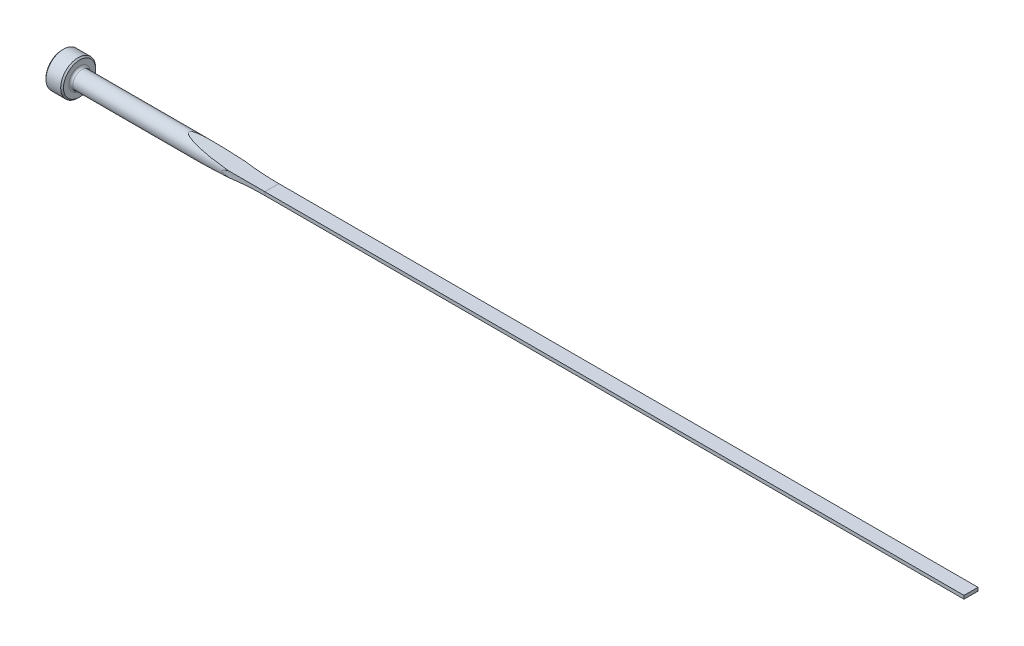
ISO-10303-21;
HEADER;
FILE_DESCRIPTION(('STEP AP214'),'2;1');
FILE_NAME('part.step','',(''),(''),'','','');
FILE_SCHEMA(('AUTOMOTIVE_DESIGN { 1 0 10303 214 1 1 1 1 }'));
ENDSEC;
DATA;
#1=APPLICATION_CONTEXT('core data for automotive mechanical design processes');
#2=APPLICATION_PROTOCOL_DEFINITION('international standard','automotive_design',2000,#1);
#3=PRODUCT_CONTEXT('',#1,'mechanical');
#4=PRODUCT('Part','Part','',(#3));
#5=PRODUCT_RELATED_PRODUCT_CATEGORY('part','',(#4));
#6=PRODUCT_DEFINITION_FORMATION('','',#4);
#7=PRODUCT_DEFINITION_CONTEXT('part definition',#1,'design');
#8=PRODUCT_DEFINITION('design','',#6,#7);
#9=PRODUCT_DEFINITION_SHAPE('','',#8);
#10=(LENGTH_UNIT() NAMED_UNIT(*) SI_UNIT(.MILLI.,.METRE.));
#11=(NAMED_UNIT(*) PLANE_ANGLE_UNIT() SI_UNIT($,.RADIAN.));
#12=(NAMED_UNIT(*) SI_UNIT($,.STERADIAN.) SOLID_ANGLE_UNIT());
#13=UNCERTAINTY_MEASURE_WITH_UNIT(LENGTH_MEASURE(1.E-05),#10,'distance_accuracy_value','');
#14=(GEOMETRIC_REPRESENTATION_CONTEXT(3) GLOBAL_UNCERTAINTY_ASSIGNED_CONTEXT((#13)) GLOBAL_UNIT_ASSIGNED_CONTEXT((#10,
#11,#12)) REPRESENTATION_CONTEXT('',''));
#15=CARTESIAN_POINT('',(0.,0.,0.));
#16=DIRECTION('',(0.,0.,1.));
#17=DIRECTION('',(1.,0.,0.));
#18=AXIS2_PLACEMENT_3D('',#15,#16,#17);
#19=CARTESIAN_POINT('',(0.,0.,0.));
#20=DIRECTION('',(-1.,0.,0.));
#21=DIRECTION('',(0.,0.,1.));
#22=AXIS2_PLACEMENT_3D('',#19,#20,#21);
#23=CYLINDRICAL_SURFACE('',#22,1.5875);
#24=CARTESIAN_POINT('',(3.556,0.,0.));
#25=DIRECTION('',(-1.,0.,0.));
#26=DIRECTION('',(0.,0.,1.));
#27=AXIS2_PLACEMENT_3D('',#24,#25,#26);
#28=CIRCLE('',#27,1.5875);
#29=CARTESIAN_POINT('',(3.556,0.,1.5875));
#30=VERTEX_POINT('',#29);
#31=EDGE_CURVE('E164',#30,#30,#28,.F.);
#32=ORIENTED_EDGE('',*,*,#31,.T.);
#33=EDGE_LOOP('',(#32));
#34=FACE_BOUND('',#33,.T.);
#35=CARTESIAN_POINT('',(38.1,0.952500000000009,1.26999999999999));
#36=CARTESIAN_POINT('',(37.8359370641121,0.952472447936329,1.26999969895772));
#37=CARTESIAN_POINT('',(37.5718719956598,0.950929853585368,1.27117652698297));
#38=CARTESIAN_POINT('',(37.0437498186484,0.944621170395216,1.27588282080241));
#39=CARTESIAN_POINT('',(36.7796927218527,0.939854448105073,1.27941274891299));
#40=CARTESIAN_POINT('',(36.2503777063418,0.926871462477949,1.28884723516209));
#41=CARTESIAN_POINT('',(35.9851204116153,0.918638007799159,1.29476362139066));
#42=CARTESIAN_POINT('',(35.4548543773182,0.898288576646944,1.30896501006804));
#43=CARTESIAN_POINT('',(35.1898456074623,0.88617315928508,1.31724967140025));
#44=CARTESIAN_POINT('',(34.6601718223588,0.857369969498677,1.33617874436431));
#45=CARTESIAN_POINT('',(34.3955067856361,0.840682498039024,1.34682300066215));
#46=CARTESIAN_POINT('',(33.8665932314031,0.801572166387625,1.37045957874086));
#47=CARTESIAN_POINT('',(33.6023449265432,0.779146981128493,1.38345285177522));
#48=CARTESIAN_POINT('',(33.0751041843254,0.726695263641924,1.41173301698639));
#49=CARTESIAN_POINT('',(32.8121104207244,0.696680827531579,1.42701624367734));
#50=CARTESIAN_POINT('',(32.419006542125,0.642939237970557,1.45160532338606));
#51=CARTESIAN_POINT('',(32.2882488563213,0.623580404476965,1.46007578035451));
#52=CARTESIAN_POINT('',(32.0274086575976,0.580985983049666,1.47754992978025));
#53=CARTESIAN_POINT('',(31.8973260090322,0.557751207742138,1.48655351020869));
#54=CARTESIAN_POINT('',(31.7029417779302,0.51869086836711,1.50043429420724));
#55=CARTESIAN_POINT('',(31.6382079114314,0.50495402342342,1.50512852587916));
#56=CARTESIAN_POINT('',(31.5091163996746,0.475697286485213,1.51463106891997));
#57=CARTESIAN_POINT('',(31.444758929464,0.460176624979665,1.51943942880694));
#58=CARTESIAN_POINT('',(31.3166394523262,0.426797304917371,1.52915077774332));
#59=CARTESIAN_POINT('',(31.2528776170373,0.408937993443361,1.53405379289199));
#60=CARTESIAN_POINT('',(31.1263676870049,0.369981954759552,1.54391773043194));
#61=CARTESIAN_POINT('',(31.0636187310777,0.348888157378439,1.54887859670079));
#62=CARTESIAN_POINT('',(30.9537745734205,0.306832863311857,1.55767690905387));
#63=CARTESIAN_POINT('',(30.9062912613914,0.286877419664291,1.5615197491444));
#64=CARTESIAN_POINT('',(30.8135147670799,0.242118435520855,1.56910131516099));
#65=CARTESIAN_POINT('',(30.7682167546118,0.217326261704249,1.57284026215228));
#66=CARTESIAN_POINT('',(30.7094526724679,0.176210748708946,1.5777311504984));
#67=CARTESIAN_POINT('',(30.6933005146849,0.163830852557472,1.57908035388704));
#68=CARTESIAN_POINT('',(30.6628115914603,0.137009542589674,1.58163476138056));
#69=CARTESIAN_POINT('',(30.6484664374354,0.12257837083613,1.58284062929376));
#70=CARTESIAN_POINT('',(30.6298776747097,0.0993254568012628,1.58440687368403));
#71=CARTESIAN_POINT('',(30.6243089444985,0.0915828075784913,1.58487670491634));
#72=CARTESIAN_POINT('',(30.6142247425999,0.0754170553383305,1.58572829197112));
#73=CARTESIAN_POINT('',(30.609709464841,0.0669938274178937,1.58611003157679));
#74=CARTESIAN_POINT('',(30.6020627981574,0.0493687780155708,1.58675692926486));
#75=CARTESIAN_POINT('',(30.5989527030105,0.0401573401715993,1.58702029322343));
#76=CARTESIAN_POINT('',(30.5946485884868,0.021299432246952,1.58738485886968));
#77=CARTESIAN_POINT('',(30.5934494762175,0.0116541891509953,1.58748649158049));
#78=CARTESIAN_POINT('',(30.5931810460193,-0.00627689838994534,1.58750924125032));
#79=CARTESIAN_POINT('',(30.5938309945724,-0.0145593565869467,1.58745415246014));
#80=CARTESIAN_POINT('',(30.596586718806,-0.0308792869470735,1.58722068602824));
#81=CARTESIAN_POINT('',(30.5986943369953,-0.0389164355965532,1.58704215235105));
#82=CARTESIAN_POINT('',(30.6048784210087,-0.056694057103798,1.58651867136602));
#83=CARTESIAN_POINT('',(30.6093358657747,-0.0662986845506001,1.58614155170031));
#84=CARTESIAN_POINT('',(30.6196912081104,-0.0846844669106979,1.58526650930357));
#85=CARTESIAN_POINT('',(30.6255922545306,-0.0934637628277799,1.5847683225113));
#86=CARTESIAN_POINT('',(30.6434792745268,-0.116928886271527,1.58326042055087));
#87=CARTESIAN_POINT('',(30.6565698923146,-0.130753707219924,1.58215918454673));
#88=CARTESIAN_POINT('',(30.6844713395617,-0.156505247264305,1.57981919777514));
#89=CARTESIAN_POINT('',(30.6992876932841,-0.168425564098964,1.57858000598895));
#90=CARTESIAN_POINT('',(30.739578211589,-0.197928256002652,1.57522129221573));
#91=CARTESIAN_POINT('',(30.7658878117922,-0.214348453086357,1.57303885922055));
#92=CARTESIAN_POINT('',(30.8198696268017,-0.244796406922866,1.56858667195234));
#93=CARTESIAN_POINT('',(30.8475451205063,-0.258818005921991,1.56631671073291));
#94=CARTESIAN_POINT('',(30.9038496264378,-0.285216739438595,1.56172600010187));
#95=CARTESIAN_POINT('',(30.9324831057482,-0.297584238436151,1.55940503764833));
#96=CARTESIAN_POINT('',(30.9902313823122,-0.320999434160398,1.55475283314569));
#97=CARTESIAN_POINT('',(31.0193455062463,-0.332048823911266,1.55242160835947));
#98=CARTESIAN_POINT('',(31.1167156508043,-0.367120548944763,1.54467408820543));
#99=CARTESIAN_POINT('',(31.185758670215,-0.38894952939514,1.53925978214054));
#100=CARTESIAN_POINT('',(31.3248495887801,-0.42919515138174,1.52851860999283));
#101=CARTESIAN_POINT('',(31.3948981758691,-0.447609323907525,1.52319180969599));
#102=CARTESIAN_POINT('',(31.6062524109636,-0.499304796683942,1.50737425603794));
#103=CARTESIAN_POINT('',(31.748458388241,-0.528940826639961,1.49707091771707));
#104=CARTESIAN_POINT('',(32.0339343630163,-0.582377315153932,1.4770839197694));
#105=CARTESIAN_POINT('',(32.1772043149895,-0.606178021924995,1.46740023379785));
#106=CARTESIAN_POINT('',(32.4642106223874,-0.649595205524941,1.44870309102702));
#107=CARTESIAN_POINT('',(32.6079460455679,-0.669217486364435,1.43968871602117));
#108=CARTESIAN_POINT('',(32.9632966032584,-0.713812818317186,1.41827252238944));
#109=CARTESIAN_POINT('',(33.1751582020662,-0.736984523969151,1.40626275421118));
#110=CARTESIAN_POINT('',(33.5994492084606,-0.778441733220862,1.38373872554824));
#111=CARTESIAN_POINT('',(33.811878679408,-0.796726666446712,1.37322463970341));
#112=CARTESIAN_POINT('',(34.2372766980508,-0.829463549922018,1.35370227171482));
#113=CARTESIAN_POINT('',(34.4502455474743,-0.843912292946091,1.3446952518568));
#114=CARTESIAN_POINT('',(34.876436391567,-0.869626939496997,1.32820734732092));
#115=CARTESIAN_POINT('',(35.0896583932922,-0.880892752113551,1.32072650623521));
#116=CARTESIAN_POINT('',(35.7289383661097,-0.910591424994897,1.3006032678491));
#117=CARTESIAN_POINT('',(36.1552599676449,-0.924972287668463,1.29025032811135));
#118=CARTESIAN_POINT('',(37.0080583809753,-0.944949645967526,1.27568360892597));
#119=CARTESIAN_POINT('',(37.4345350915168,-0.950549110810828,1.27146775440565));
#120=CARTESIAN_POINT('',(37.9406819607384,-0.952355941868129,1.27010705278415));
#121=CARTESIAN_POINT('',(38.0203412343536,-0.952498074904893,1.26999997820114));
#122=CARTESIAN_POINT('',(38.1,-0.952500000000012,1.27));
#123=B_SPLINE_CURVE_WITH_KNOTS('',3,(#35,#36,#37,#38,#39,#40,#41,#42,#43,#44,#45,#46,#47,#48,
#49,#50,#51,#52,#53,#54,#55,#56,#57,#58,#59,#60,#61,#62,#63,#64,#65,#66,#67,#68,#69,#70,#71,#72,
#73,#74,#75,#76,#77,#78,#79,#80,#81,#82,#83,#84,#85,#86,#87,#88,#89,#90,#91,#92,#93,#94,#95,#96,
#97,#98,#99,#100,#101,#102,#103,#104,#105,#106,#107,#108,#109,#110,#111,#112,#113,#114,#115,
#116,#117,#118,#119,#120,#121,#122),.UNSPECIFIED.,.F.,.F.,(4,2,2,2,2,2,2,2,2,2,2,2,2,2,2,2,2,2,
2,2,2,2,2,2,2,2,2,2,2,2,2,2,2,2,2,2,2,2,2,2,2,2,2,4),(0.,0.79218509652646,1.58452588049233,
2.38084299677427,3.17704547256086,3.97319554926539,4.7696687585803,5.56488042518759,
5.96220645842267,6.359449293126,6.55845704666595,6.75755097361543,6.95670060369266,
7.15567089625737,7.31055958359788,7.46508856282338,7.52618112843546,7.58697872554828,
7.61556379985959,7.6441541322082,7.67316426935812,7.7020969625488,7.72688104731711,
7.75169651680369,7.78330369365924,7.81498043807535,7.87187149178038,7.92894994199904,
8.02197622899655,8.11523786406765,8.20902108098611,8.30268251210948,8.52035294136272,
8.7381801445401,9.1748051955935,9.6114116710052,10.047407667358,10.6877093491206,
11.3280857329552,11.968995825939,12.6099242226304,13.889825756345,15.1692944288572,
15.4082719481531),.UNSPECIFIED.);
#124=CARTESIAN_POINT('',(31.7636874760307,0.53089660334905,1.49609660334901));
#125=VERTEX_POINT('',#124);
#126=CARTESIAN_POINT('',(31.7636874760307,-0.530896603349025,1.49609660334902));
#127=VERTEX_POINT('',#126);
#128=EDGE_CURVE('E167',#125,#127,#123,.T.);
#129=ORIENTED_EDGE('',*,*,#128,.F.);
#130=CARTESIAN_POINT('',(38.1,0.30479999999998,1.55796444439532));
#131=CARTESIAN_POINT('',(37.8353011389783,0.304799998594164,1.5579600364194));
#132=CARTESIAN_POINT('',(37.57060375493,0.305982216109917,1.55773375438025));
#133=CARTESIAN_POINT('',(37.0412315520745,0.31071091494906,1.5567990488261));
#134=CARTESIAN_POINT('',(36.7765567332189,0.31425739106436,1.55609062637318));
#135=CARTESIAN_POINT('',(35.982819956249,0.328438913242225,1.55318538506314));
#136=CARTESIAN_POINT('',(35.453819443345,0.342616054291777,1.55020865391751));
#137=CARTESIAN_POINT('',(34.3958879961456,0.380423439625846,1.54136681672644));
#138=CARTESIAN_POINT('',(33.8669572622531,0.404058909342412,1.53550011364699));
#139=CARTESIAN_POINT('',(32.8096723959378,0.460770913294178,1.51944577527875));
#140=CARTESIAN_POINT('',(32.2813182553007,0.493847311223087,1.50925820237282));
#141=CARTESIAN_POINT('',(31.2247384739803,0.569470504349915,1.48239356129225));
#142=CARTESIAN_POINT('',(30.6965139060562,0.612029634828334,1.46570801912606));
#143=CARTESIAN_POINT('',(29.9051424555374,0.682913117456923,1.43333460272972));
#144=CARTESIAN_POINT('',(29.6415261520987,0.70771364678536,1.42132007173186));
#145=CARTESIAN_POINT('',(29.1146810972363,0.759652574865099,1.39425471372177));
#146=CARTESIAN_POINT('',(28.851452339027,0.786790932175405,1.37920394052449));
#147=CARTESIAN_POINT('',(28.3250875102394,0.843432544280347,1.34531370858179));
#148=CARTESIAN_POINT('',(28.0619521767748,0.872939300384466,1.32646857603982));
#149=CARTESIAN_POINT('',(27.5362918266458,0.934260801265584,1.2840204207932));
#150=CARTESIAN_POINT('',(27.2737668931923,0.966075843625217,1.26041678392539));
#151=CARTESIAN_POINT('',(26.7505642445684,1.03184735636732,1.20715852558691));
#152=CARTESIAN_POINT('',(26.4898832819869,1.06579569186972,1.1775260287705));
#153=CARTESIAN_POINT('',(25.9699145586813,1.13585102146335,1.11013144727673));
#154=CARTESIAN_POINT('',(25.7106263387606,1.17195724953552,1.07237223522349));
#155=CARTESIAN_POINT('',(25.3235582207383,1.22758978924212,1.00696688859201));
#156=CARTESIAN_POINT('',(25.1949283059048,1.24636695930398,0.983721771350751));
#157=CARTESIAN_POINT('',(24.9383758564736,1.28439017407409,0.933540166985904));
#158=CARTESIAN_POINT('',(24.8104537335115,1.3036364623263,0.906601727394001));
#159=CARTESIAN_POINT('',(24.5544453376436,1.342721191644,0.847654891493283));
#160=CARTESIAN_POINT('',(24.4263709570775,1.36256369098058,0.815597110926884));
#161=CARTESIAN_POINT('',(24.1722250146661,1.40250182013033,0.744863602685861));
#162=CARTESIAN_POINT('',(24.0461508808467,1.42259705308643,0.706197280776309));
#163=CARTESIAN_POINT('',(23.8587621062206,1.45286988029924,0.640242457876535));
#164=CARTESIAN_POINT('',(23.7961333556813,1.46305770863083,0.616729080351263));
#165=CARTESIAN_POINT('',(23.6721005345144,1.48336776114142,0.566149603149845));
#166=CARTESIAN_POINT('',(23.6107002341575,1.49348973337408,0.539074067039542));
#167=CARTESIAN_POINT('',(23.4911211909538,1.51332806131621,0.480568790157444));
#168=CARTESIAN_POINT('',(23.4329059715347,1.52304835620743,0.449218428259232));
#169=CARTESIAN_POINT('',(23.3488755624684,1.53715979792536,0.397004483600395));
#170=CARTESIAN_POINT('',(23.3214691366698,1.54177609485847,0.37877946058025));
#171=CARTESIAN_POINT('',(23.2682406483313,1.55076622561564,0.340113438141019));
#172=CARTESIAN_POINT('',(23.2424164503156,1.55514038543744,0.31967553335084));
#173=CARTESIAN_POINT('',(23.2014408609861,1.56209800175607,0.283239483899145));
#174=CARTESIAN_POINT('',(23.1856051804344,1.56479166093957,0.268037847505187));
#175=CARTESIAN_POINT('',(23.1554392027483,1.56993059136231,0.236086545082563));
#176=CARTESIAN_POINT('',(23.1411118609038,1.57237537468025,0.219333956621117));
#177=CARTESIAN_POINT('',(23.1145238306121,1.57691809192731,0.183872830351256));
#178=CARTESIAN_POINT('',(23.1022890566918,1.57901167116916,0.165143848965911));
#179=CARTESIAN_POINT('',(23.081178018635,1.58262756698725,0.125824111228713));
#180=CARTESIAN_POINT('',(23.0722912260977,1.58415167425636,0.105239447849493));
#181=CARTESIAN_POINT('',(23.0611077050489,1.58607060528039,0.0689918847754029));
#182=CARTESIAN_POINT('',(23.0576335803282,1.58666707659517,0.0537061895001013));
#183=CARTESIAN_POINT('',(23.0532953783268,1.58741196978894,0.0227608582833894));
#184=CARTESIAN_POINT('',(23.0524285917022,1.58756085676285,0.00710162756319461));
#185=CARTESIAN_POINT('',(23.0534033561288,1.58739345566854,-0.0241343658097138));
#186=CARTESIAN_POINT('',(23.0552461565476,1.58707695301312,-0.0397110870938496));
#187=CARTESIAN_POINT('',(23.0614321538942,1.58601498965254,-0.0703458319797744));
#188=CARTESIAN_POINT('',(23.0657781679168,1.58526904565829,-0.0854032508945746));
#189=CARTESIAN_POINT('',(23.0786251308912,1.58306552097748,-0.120296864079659));
#190=CARTESIAN_POINT('',(23.0880781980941,1.58144509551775,-0.13976834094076));
#191=CARTESIAN_POINT('',(23.109858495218,1.5777163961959,-0.176970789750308));
#192=CARTESIAN_POINT('',(23.1221929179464,1.5756069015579,-0.194697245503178));
#193=CARTESIAN_POINT('',(23.1595525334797,1.56922723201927,-0.242152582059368));
#194=CARTESIAN_POINT('',(23.1868003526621,1.56458478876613,-0.270055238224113));
#195=CARTESIAN_POINT('',(23.2447189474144,1.55474863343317,-0.321877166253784));
#196=CARTESIAN_POINT('',(23.2754003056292,1.54955321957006,-0.345783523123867));
#197=CARTESIAN_POINT('',(23.3580421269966,1.53560740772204,-0.404292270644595));
#198=CARTESIAN_POINT('',(23.4115966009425,1.52661646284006,-0.436558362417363));
#199=CARTESIAN_POINT('',(23.5213757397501,1.50829581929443,-0.496143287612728));
#200=CARTESIAN_POINT('',(23.5776066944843,1.49896533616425,-0.523449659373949));
#201=CARTESIAN_POINT('',(23.6919511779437,1.48010847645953,-0.574614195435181));
#202=CARTESIAN_POINT('',(23.750073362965,1.47058130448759,-0.598452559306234));
#203=CARTESIAN_POINT('',(23.8672672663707,1.4514932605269,-0.643362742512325));
#204=CARTESIAN_POINT('',(23.9263376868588,1.44193244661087,-0.664438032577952));
#205=CARTESIAN_POINT('',(24.0534477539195,1.42149254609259,-0.707214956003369));
#206=CARTESIAN_POINT('',(24.1215943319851,1.41061467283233,-0.728597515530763));
#207=CARTESIAN_POINT('',(24.2585558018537,1.38891741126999,-0.769149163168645));
#208=CARTESIAN_POINT('',(24.3273707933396,1.3780980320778,-0.788317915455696));
#209=CARTESIAN_POINT('',(24.5346249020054,1.34576435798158,-0.843142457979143));
#210=CARTESIAN_POINT('',(24.6738002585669,1.3243862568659,-0.876093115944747));
#211=CARTESIAN_POINT('',(24.9536767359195,1.28208231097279,-0.936900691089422));
#212=CARTESIAN_POINT('',(25.0943808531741,1.26115776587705,-0.964744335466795));
#213=CARTESIAN_POINT('',(25.376555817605,1.21989054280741,-1.01642307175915));
#214=CARTESIAN_POINT('',(25.5180264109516,1.19954768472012,-1.04025941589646));
#215=CARTESIAN_POINT('',(25.8016417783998,1.15946558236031,-1.08475385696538));
#216=CARTESIAN_POINT('',(25.9437869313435,1.13972673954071,-1.10540987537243));
#217=CARTESIAN_POINT('',(26.2285302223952,1.10089058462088,-1.14409207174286));
#218=CARTESIAN_POINT('',(26.3711283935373,1.08179332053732,-1.16211805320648));
#219=CARTESIAN_POINT('',(26.6564568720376,1.04428732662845,-1.19593327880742));
#220=CARTESIAN_POINT('',(26.7991866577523,1.02587760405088,-1.21172584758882));
#221=CARTESIAN_POINT('',(27.0849220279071,0.989728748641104,-1.241426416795));
#222=CARTESIAN_POINT('',(27.2279276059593,0.971989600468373,-1.25533446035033));
#223=CARTESIAN_POINT('',(27.5868673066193,0.928351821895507,-1.28817728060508));
#224=CARTESIAN_POINT('',(27.8029488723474,0.902885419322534,-1.30607701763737));
#225=CARTESIAN_POINT('',(28.2355206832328,0.853515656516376,-1.33885781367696));
#226=CARTESIAN_POINT('',(28.452010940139,0.829612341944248,-1.35373878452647));
#227=CARTESIAN_POINT('',(29.1020151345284,0.760262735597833,-1.39465442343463));
#228=CARTESIAN_POINT('',(29.5360187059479,0.71718210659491,-1.41695804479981));
#229=CARTESIAN_POINT('',(30.4052994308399,0.637355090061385,-1.45460145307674));
#230=CARTESIAN_POINT('',(30.8405773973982,0.600614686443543,-1.46993468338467));
#231=CARTESIAN_POINT('',(31.7117802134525,0.533544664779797,-1.49558509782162));
#232=CARTESIAN_POINT('',(32.1477050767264,0.503215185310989,-1.50590217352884));
#233=CARTESIAN_POINT('',(33.0192628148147,0.449031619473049,-1.52293440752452));
#234=CARTESIAN_POINT('',(33.4548948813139,0.425166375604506,-1.52965579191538));
#235=CARTESIAN_POINT('',(34.3265018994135,0.383850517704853,-1.54054235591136));
#236=CARTESIAN_POINT('',(34.7624768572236,0.366400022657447,-1.54470748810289));
#237=CARTESIAN_POINT('',(35.6344823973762,0.337925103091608,-1.55118513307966));
#238=CARTESIAN_POINT('',(36.0705128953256,0.326898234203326,-1.55349835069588));
#239=CARTESIAN_POINT('',(36.942685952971,0.311263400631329,-1.55670658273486));
#240=CARTESIAN_POINT('',(37.3788285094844,0.306655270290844,-1.55760163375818));
#241=CARTESIAN_POINT('',(37.8624796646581,0.305104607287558,-1.55790475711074));
#242=CARTESIAN_POINT('',(37.9099838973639,0.304990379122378,-1.55792715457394));
#243=CARTESIAN_POINT('',(38.0049920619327,0.304838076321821,-1.55795703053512));
#244=CARTESIAN_POINT('',(38.0524959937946,0.304800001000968,-1.5579645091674));
#245=CARTESIAN_POINT('',(38.1,0.304799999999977,-1.55796444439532));
#246=B_SPLINE_CURVE_WITH_KNOTS('',3,(#130,#131,#132,#133,#134,#135,#136,#137,#138,#139,#140,
#141,#142,#143,#144,#145,#146,#147,#148,#149,#150,#151,#152,#153,#154,#155,#156,#157,#158,#159,
#160,#161,#162,#163,#164,#165,#166,#167,#168,#169,#170,#171,#172,#173,#174,#175,#176,#177,#178,
#179,#180,#181,#182,#183,#184,#185,#186,#187,#188,#189,#190,#191,#192,#193,#194,#195,#196,#197,
#198,#199,#200,#201,#202,#203,#204,#205,#206,#207,#208,#209,#210,#211,#212,#213,#214,#215,#216,
#217,#218,#219,#220,#221,#222,#223,#224,#225,#226,#227,#228,#229,#230,#231,#232,#233,#234,#235,
#236,#237,#238,#239,#240,#241,#242,#243,#244,#245),.UNSPECIFIED.,.F.,.F.,(4,2,2,2,2,2,2,2,2,2,2,
2,2,2,2,2,2,2,2,2,2,2,2,2,2,2,2,2,2,2,2,2,2,2,2,2,2,2,2,2,2,2,2,2,2,2,2,2,2,2,2,2,2,2,2,2,2,4),
(0.,0.794090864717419,1.58817998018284,3.17567961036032,4.76405749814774,6.35241245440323,
7.94284575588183,8.73798215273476,9.53310445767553,10.329424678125,11.1258477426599,
11.9193991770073,12.7126705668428,13.1087973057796,13.5051342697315,13.9055554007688,
14.3054112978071,14.5083390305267,14.711815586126,14.9119284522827,15.0115607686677,
15.1110555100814,15.1773253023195,15.2437226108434,15.3108905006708,15.3778453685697,
15.4247037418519,15.4715134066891,15.518344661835,15.5652287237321,15.629973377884,
15.6948814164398,15.8120443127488,15.9295788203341,16.1185881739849,16.3080660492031,
16.4985865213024,16.6888653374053,16.9055543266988,17.1222761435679,17.5559518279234,
17.990739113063,18.4253902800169,18.8603243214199,19.2952908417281,19.7296029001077,
20.1639050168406,20.8188065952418,21.4737272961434,22.7837014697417,24.0949053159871,
25.4061375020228,26.7150918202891,28.0240704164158,29.3325505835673,30.6409969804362,
30.783510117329,30.9260219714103),.UNSPECIFIED.);
#247=CARTESIAN_POINT('',(31.7636874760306,0.530896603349,-1.49609660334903));
#248=VERTEX_POINT('',#247);
#249=EDGE_CURVE('E113',#125,#248,#246,.T.);
#250=ORIENTED_EDGE('',*,*,#249,.T.);
#251=CARTESIAN_POINT('',(38.1,0.952500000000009,-1.26999999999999));
#252=CARTESIAN_POINT('',(37.8359370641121,0.952472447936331,-1.26999969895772));
#253=CARTESIAN_POINT('',(37.5718719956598,0.950929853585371,-1.27117652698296));
#254=CARTESIAN_POINT('',(37.0437498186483,0.944621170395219,-1.27588282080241));
#255=CARTESIAN_POINT('',(36.7796927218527,0.939854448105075,-1.27941274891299));
#256=CARTESIAN_POINT('',(36.2503777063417,0.92687146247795,-1.28884723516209));
#257=CARTESIAN_POINT('',(35.9851204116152,0.91863800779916,-1.29476362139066));
#258=CARTESIAN_POINT('',(35.4548543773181,0.898288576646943,-1.30896501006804));
#259=CARTESIAN_POINT('',(35.1898456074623,0.886173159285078,-1.31724967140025));
#260=CARTESIAN_POINT('',(34.6601718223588,0.857369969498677,-1.33617874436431));
#261=CARTESIAN_POINT('',(34.3955067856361,0.840682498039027,-1.34682300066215));
#262=CARTESIAN_POINT('',(33.8665932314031,0.801572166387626,-1.37045957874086));
#263=CARTESIAN_POINT('',(33.6023449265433,0.779146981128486,-1.38345285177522));
#264=CARTESIAN_POINT('',(33.0751041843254,0.726695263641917,-1.4117330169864));
#265=CARTESIAN_POINT('',(32.8121104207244,0.696680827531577,-1.42701624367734));
#266=CARTESIAN_POINT('',(32.419006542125,0.642939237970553,-1.45160532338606));
#267=CARTESIAN_POINT('',(32.2882488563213,0.623580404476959,-1.46007578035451));
#268=CARTESIAN_POINT('',(32.0274086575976,0.580985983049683,-1.47754992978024));
#269=CARTESIAN_POINT('',(31.8973260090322,0.55775120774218,-1.48655351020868));
#270=CARTESIAN_POINT('',(31.7029417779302,0.518690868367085,-1.50043429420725));
#271=CARTESIAN_POINT('',(31.6382079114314,0.504954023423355,-1.50512852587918));
#272=CARTESIAN_POINT('',(31.5091163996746,0.475697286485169,-1.51463106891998));
#273=CARTESIAN_POINT('',(31.444758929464,0.460176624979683,-1.51943942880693));
#274=CARTESIAN_POINT('',(31.3166394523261,0.426797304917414,-1.52915077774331));
#275=CARTESIAN_POINT('',(31.2528776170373,0.408937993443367,-1.53405379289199));
#276=CARTESIAN_POINT('',(31.1263676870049,0.369981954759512,-1.54391773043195));
#277=CARTESIAN_POINT('',(31.0636187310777,0.34888815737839,-1.5488785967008));
#278=CARTESIAN_POINT('',(30.9537745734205,0.306832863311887,-1.55767690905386));
#279=CARTESIAN_POINT('',(30.9062912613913,0.286877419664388,-1.56151974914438));
#280=CARTESIAN_POINT('',(30.8135147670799,0.242118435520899,-1.56910131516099));
#281=CARTESIAN_POINT('',(30.7682167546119,0.21732626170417,-1.57284026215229));
#282=CARTESIAN_POINT('',(30.709452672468,0.176210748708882,-1.5777311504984));
#283=CARTESIAN_POINT('',(30.6933005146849,0.163830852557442,-1.57908035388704));
#284=CARTESIAN_POINT('',(30.6628115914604,0.13700954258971,-1.58163476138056));
#285=CARTESIAN_POINT('',(30.6484664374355,0.122578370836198,-1.58284062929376));
#286=CARTESIAN_POINT('',(30.6298776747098,0.0993254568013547,-1.58440687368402));
#287=CARTESIAN_POINT('',(30.6243089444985,0.0915828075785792,-1.58487670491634));
#288=CARTESIAN_POINT('',(30.6142247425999,0.0754170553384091,-1.58572829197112));
#289=CARTESIAN_POINT('',(30.609709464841,0.0669938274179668,-1.58611003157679));
#290=CARTESIAN_POINT('',(30.6020627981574,0.0493687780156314,-1.58675692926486));
#291=CARTESIAN_POINT('',(30.5989527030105,0.0401573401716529,-1.58702029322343));
#292=CARTESIAN_POINT('',(30.5946485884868,0.0212994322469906,-1.58738485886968));
#293=CARTESIAN_POINT('',(30.5934494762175,0.0116541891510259,-1.58748649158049));
#294=CARTESIAN_POINT('',(30.5931810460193,-0.00627689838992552,-1.58750924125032));
#295=CARTESIAN_POINT('',(30.5938309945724,-0.0145593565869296,-1.58745415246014));
#296=CARTESIAN_POINT('',(30.596586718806,-0.0308792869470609,-1.58722068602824));
#297=CARTESIAN_POINT('',(30.5986943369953,-0.0389164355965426,-1.58704215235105));
#298=CARTESIAN_POINT('',(30.6048784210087,-0.0566940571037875,-1.58651867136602));
#299=CARTESIAN_POINT('',(30.6093358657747,-0.0662986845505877,-1.58614155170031));
#300=CARTESIAN_POINT('',(30.6196912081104,-0.084684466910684,-1.58526650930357));
#301=CARTESIAN_POINT('',(30.6255922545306,-0.0934637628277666,-1.5847683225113));
#302=CARTESIAN_POINT('',(30.6434792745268,-0.116928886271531,-1.58326042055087));
#303=CARTESIAN_POINT('',(30.6565698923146,-0.13075370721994,-1.58215918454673));
#304=CARTESIAN_POINT('',(30.6844713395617,-0.156505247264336,-1.57981919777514));
#305=CARTESIAN_POINT('',(30.6992876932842,-0.168425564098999,-1.57858000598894));
#306=CARTESIAN_POINT('',(30.7395782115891,-0.197928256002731,-1.57522129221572));
#307=CARTESIAN_POINT('',(30.7658878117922,-0.214348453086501,-1.57303885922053));
#308=CARTESIAN_POINT('',(30.8198696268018,-0.244796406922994,-1.56858667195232));
#309=CARTESIAN_POINT('',(30.8475451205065,-0.258818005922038,-1.5663167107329));
#310=CARTESIAN_POINT('',(30.903849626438,-0.285216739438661,-1.56172600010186));
#311=CARTESIAN_POINT('',(30.9324831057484,-0.297584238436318,-1.5594050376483));
#312=CARTESIAN_POINT('',(30.9902313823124,-0.320999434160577,-1.55475283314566));
#313=CARTESIAN_POINT('',(31.0193455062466,-0.332048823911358,-1.55242160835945));
#314=CARTESIAN_POINT('',(31.1167156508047,-0.367120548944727,-1.54467408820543));
#315=CARTESIAN_POINT('',(31.1857586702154,-0.388949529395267,-1.5392597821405));
#316=CARTESIAN_POINT('',(31.3248495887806,-0.429195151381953,-1.52851860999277));
#317=CARTESIAN_POINT('',(31.3948981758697,-0.44760932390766,-1.52319180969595));
#318=CARTESIAN_POINT('',(31.6062524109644,-0.499304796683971,-1.50737425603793));
#319=CARTESIAN_POINT('',(31.7484583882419,-0.528940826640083,-1.49707091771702));
#320=CARTESIAN_POINT('',(32.0339343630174,-0.582377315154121,-1.47708391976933));
#321=CARTESIAN_POINT('',(32.1772043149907,-0.606178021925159,-1.46740023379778));
#322=CARTESIAN_POINT('',(32.4642106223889,-0.649595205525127,-1.44870309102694));
#323=CARTESIAN_POINT('',(32.6079460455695,-0.669217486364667,-1.43968871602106));
#324=CARTESIAN_POINT('',(32.9632966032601,-0.713812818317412,-1.41827252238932));
#325=CARTESIAN_POINT('',(33.1751582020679,-0.736984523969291,-1.40626275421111));
#326=CARTESIAN_POINT('',(33.5994492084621,-0.778441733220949,-1.38373872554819));
#327=CARTESIAN_POINT('',(33.8118786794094,-0.796726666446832,-1.37322463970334));
#328=CARTESIAN_POINT('',(34.2372766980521,-0.829463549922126,-1.35370227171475));
#329=CARTESIAN_POINT('',(34.4502455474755,-0.843912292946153,-1.34469525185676));
#330=CARTESIAN_POINT('',(34.8764363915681,-0.869626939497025,-1.3282073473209));
#331=CARTESIAN_POINT('',(35.0896583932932,-0.88089275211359,-1.32072650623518));
#332=CARTESIAN_POINT('',(35.7289383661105,-0.910591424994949,-1.30060326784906));
#333=CARTESIAN_POINT('',(36.1552599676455,-0.9249722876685,-1.29025032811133));
#334=CARTESIAN_POINT('',(37.0080583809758,-0.944949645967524,-1.27568360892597));
#335=CARTESIAN_POINT('',(37.4345350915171,-0.950549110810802,-1.27146775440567));
#336=CARTESIAN_POINT('',(37.9406819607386,-0.952355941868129,-1.27010705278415));
#337=CARTESIAN_POINT('',(38.0203412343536,-0.952498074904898,-1.26999997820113));
#338=CARTESIAN_POINT('',(38.1,-0.952500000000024,-1.26999999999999));
#339=B_SPLINE_CURVE_WITH_KNOTS('',3,(#251,#252,#253,#254,#255,#256,#257,#258,#259,#260,#261,
#262,#263,#264,#265,#266,#267,#268,#269,#270,#271,#272,#273,#274,#275,#276,#277,#278,#279,#280,
#281,#282,#283,#284,#285,#286,#287,#288,#289,#290,#291,#292,#293,#294,#295,#296,#297,#298,#299,
#300,#301,#302,#303,#304,#305,#306,#307,#308,#309,#310,#311,#312,#313,#314,#315,#316,#317,#318,
#319,#320,#321,#322,#323,#324,#325,#326,#327,#328,#329,#330,#331,#332,#333,#334,#335,#336,#337,
#338),.UNSPECIFIED.,.F.,.F.,(4,2,2,2,2,2,2,2,2,2,2,2,2,2,2,2,2,2,2,2,2,2,2,2,2,2,2,2,2,2,2,2,2,
2,2,2,2,2,2,2,2,2,2,4),(0.,0.792185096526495,1.5845258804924,2.3808429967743,3.17704547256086,
3.97319554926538,4.76966875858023,5.56488042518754,5.96220645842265,6.35944929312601,
6.55845704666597,6.75755097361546,6.95670060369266,7.15567089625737,7.31055958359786,
7.46508856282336,7.52618112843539,7.58697872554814,7.61556379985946,7.6441541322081,
7.67316426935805,7.70209696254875,7.72688104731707,7.75169651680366,7.7833036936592,
7.81498043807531,7.8718714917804,7.92894994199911,8.02197622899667,8.11523786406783,
8.20902108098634,8.30268251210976,8.52035294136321,8.73818014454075,9.17480519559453,
9.61141167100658,10.0474076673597,10.6877093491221,11.3280857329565,11.9689958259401,
12.6099242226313,13.8898257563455,15.1692944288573,15.4082719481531),.UNSPECIFIED.);
#340=CARTESIAN_POINT('',(31.7636874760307,-0.530896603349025,-1.49609660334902));
#341=VERTEX_POINT('',#340);
#342=EDGE_CURVE('E188',#248,#341,#339,.T.);
#343=ORIENTED_EDGE('',*,*,#342,.T.);
#344=CARTESIAN_POINT('',(38.1,-0.30479999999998,1.55796444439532));
#345=CARTESIAN_POINT('',(37.8353011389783,-0.304799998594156,1.5579600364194));
#346=CARTESIAN_POINT('',(37.57060375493,-0.305982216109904,1.55773375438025));
#347=CARTESIAN_POINT('',(37.0412315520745,-0.310710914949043,1.5567990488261));
#348=CARTESIAN_POINT('',(36.7765567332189,-0.314257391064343,1.55609062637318));
#349=CARTESIAN_POINT('',(35.982819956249,-0.328438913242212,1.55318538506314));
#350=CARTESIAN_POINT('',(35.453819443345,-0.342616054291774,1.55020865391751));
#351=CARTESIAN_POINT('',(34.3958879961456,-0.380423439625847,1.54136681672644));
#352=CARTESIAN_POINT('',(33.8669572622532,-0.404058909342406,1.53550011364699));
#353=CARTESIAN_POINT('',(32.8096723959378,-0.460770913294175,1.51944577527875));
#354=CARTESIAN_POINT('',(32.2813182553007,-0.493847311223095,1.50925820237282));
#355=CARTESIAN_POINT('',(31.2247384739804,-0.569470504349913,1.48239356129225));
#356=CARTESIAN_POINT('',(30.6965139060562,-0.612029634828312,1.46570801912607));
#357=CARTESIAN_POINT('',(29.9051424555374,-0.682913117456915,1.43333460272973));
#358=CARTESIAN_POINT('',(29.6415261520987,-0.707713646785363,1.42132007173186));
#359=CARTESIAN_POINT('',(29.1146810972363,-0.759652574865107,1.39425471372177));
#360=CARTESIAN_POINT('',(28.851452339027,-0.786790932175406,1.37920394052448));
#361=CARTESIAN_POINT('',(28.3250875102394,-0.843432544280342,1.3453137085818));
#362=CARTESIAN_POINT('',(28.0619521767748,-0.872939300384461,1.32646857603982));
#363=CARTESIAN_POINT('',(27.5362918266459,-0.934260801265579,1.28402042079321));
#364=CARTESIAN_POINT('',(27.2737668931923,-0.96607584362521,1.26041678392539));
#365=CARTESIAN_POINT('',(26.7505642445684,-1.03184735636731,1.20715852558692));
#366=CARTESIAN_POINT('',(26.489883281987,-1.0657956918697,1.17752602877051));
#367=CARTESIAN_POINT('',(25.9699145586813,-1.13585102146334,1.11013144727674));
#368=CARTESIAN_POINT('',(25.7106263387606,-1.17195724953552,1.07237223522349));
#369=CARTESIAN_POINT('',(25.3235582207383,-1.22758978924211,1.00696688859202));
#370=CARTESIAN_POINT('',(25.1949283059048,-1.24636695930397,0.983721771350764));
#371=CARTESIAN_POINT('',(24.9383758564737,-1.28439017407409,0.933540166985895));
#372=CARTESIAN_POINT('',(24.8104537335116,-1.30363646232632,0.906601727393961));
#373=CARTESIAN_POINT('',(24.5544453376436,-1.34272119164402,0.847654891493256));
#374=CARTESIAN_POINT('',(24.4263709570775,-1.36256369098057,0.815597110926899));
#375=CARTESIAN_POINT('',(24.1722250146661,-1.40250182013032,0.744863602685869));
#376=CARTESIAN_POINT('',(24.0461508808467,-1.42259705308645,0.706197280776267));
#377=CARTESIAN_POINT('',(23.8587621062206,-1.45286988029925,0.640242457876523));
#378=CARTESIAN_POINT('',(23.7961333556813,-1.46305770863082,0.616729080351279));
#379=CARTESIAN_POINT('',(23.6721005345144,-1.48336776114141,0.566149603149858));
#380=CARTESIAN_POINT('',(23.6107002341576,-1.49348973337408,0.539074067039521));
#381=CARTESIAN_POINT('',(23.4911211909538,-1.51332806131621,0.480568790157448));
#382=CARTESIAN_POINT('',(23.4329059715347,-1.52304835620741,0.449218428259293));
#383=CARTESIAN_POINT('',(23.3488755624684,-1.53715979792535,0.397004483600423));
#384=CARTESIAN_POINT('',(23.3214691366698,-1.54177609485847,0.378779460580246));
#385=CARTESIAN_POINT('',(23.2682406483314,-1.55076622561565,0.340113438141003));
#386=CARTESIAN_POINT('',(23.2424164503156,-1.55514038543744,0.319675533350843));
#387=CARTESIAN_POINT('',(23.2014408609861,-1.56209800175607,0.283239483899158));
#388=CARTESIAN_POINT('',(23.1856051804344,-1.56479166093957,0.268037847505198));
#389=CARTESIAN_POINT('',(23.1554392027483,-1.56993059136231,0.236086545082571));
#390=CARTESIAN_POINT('',(23.1411118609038,-1.57237537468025,0.219333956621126));
#391=CARTESIAN_POINT('',(23.1145238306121,-1.57691809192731,0.183872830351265));
#392=CARTESIAN_POINT('',(23.1022890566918,-1.57901167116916,0.165143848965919));
#393=CARTESIAN_POINT('',(23.081178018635,-1.58262756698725,0.125824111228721));
#394=CARTESIAN_POINT('',(23.0722912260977,-1.58415167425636,0.1052394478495));
#395=CARTESIAN_POINT('',(23.0611077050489,-1.58607060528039,0.0689918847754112));
#396=CARTESIAN_POINT('',(23.0576335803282,-1.58666707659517,0.0537061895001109));
#397=CARTESIAN_POINT('',(23.0532953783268,-1.58741196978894,0.0227608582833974));
#398=CARTESIAN_POINT('',(23.0524285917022,-1.58756085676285,0.00710162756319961));
#399=CARTESIAN_POINT('',(23.0534033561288,-1.58739345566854,-0.0241343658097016));
#400=CARTESIAN_POINT('',(23.0552461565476,-1.58707695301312,-0.0397110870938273));
#401=CARTESIAN_POINT('',(23.0614321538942,-1.58601498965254,-0.0703458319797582));
#402=CARTESIAN_POINT('',(23.0657781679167,-1.58526904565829,-0.0854032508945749));
#403=CARTESIAN_POINT('',(23.0786251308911,-1.58306552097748,-0.120296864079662));
#404=CARTESIAN_POINT('',(23.0880781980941,-1.58144509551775,-0.139768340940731));
#405=CARTESIAN_POINT('',(23.109858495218,-1.57771639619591,-0.176970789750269));
#406=CARTESIAN_POINT('',(23.1221929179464,-1.5756069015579,-0.194697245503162));
#407=CARTESIAN_POINT('',(23.1595525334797,-1.56922723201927,-0.242152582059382));
#408=CARTESIAN_POINT('',(23.1868003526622,-1.56458478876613,-0.270055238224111));
#409=CARTESIAN_POINT('',(23.2447189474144,-1.55474863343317,-0.321877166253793));
#410=CARTESIAN_POINT('',(23.2754003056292,-1.54955321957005,-0.345783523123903));
#411=CARTESIAN_POINT('',(23.3580421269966,-1.53560740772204,-0.404292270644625));
#412=CARTESIAN_POINT('',(23.4115966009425,-1.52661646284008,-0.436558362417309));
#413=CARTESIAN_POINT('',(23.5213757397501,-1.50829581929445,-0.496143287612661));
#414=CARTESIAN_POINT('',(23.5776066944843,-1.49896533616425,-0.523449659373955));
#415=CARTESIAN_POINT('',(23.6919511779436,-1.48010847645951,-0.574614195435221));
#416=CARTESIAN_POINT('',(23.750073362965,-1.47058130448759,-0.598452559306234));
#417=CARTESIAN_POINT('',(23.8672672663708,-1.4514932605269,-0.643362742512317));
#418=CARTESIAN_POINT('',(23.9263376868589,-1.44193244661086,-0.664438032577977));
#419=CARTESIAN_POINT('',(24.0534477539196,-1.42149254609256,-0.707214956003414));
#420=CARTESIAN_POINT('',(24.1215943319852,-1.41061467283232,-0.728597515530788));
#421=CARTESIAN_POINT('',(24.2585558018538,-1.38891741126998,-0.769149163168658));
#422=CARTESIAN_POINT('',(24.3273707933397,-1.37809803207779,-0.788317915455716));
#423=CARTESIAN_POINT('',(24.5346249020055,-1.34576435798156,-0.843142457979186));
#424=CARTESIAN_POINT('',(24.6738002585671,-1.32438625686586,-0.876093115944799));
#425=CARTESIAN_POINT('',(24.9536767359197,-1.28208231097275,-0.936900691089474));
#426=CARTESIAN_POINT('',(25.0943808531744,-1.26115776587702,-0.964744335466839));
#427=CARTESIAN_POINT('',(25.3765558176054,-1.21989054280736,-1.0164230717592));
#428=CARTESIAN_POINT('',(25.518026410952,-1.19954768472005,-1.04025941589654));
#429=CARTESIAN_POINT('',(25.8016417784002,-1.15946558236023,-1.08475385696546));
#430=CARTESIAN_POINT('',(25.943786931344,-1.13972673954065,-1.10540987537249));
#431=CARTESIAN_POINT('',(26.2285302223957,-1.10089058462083,-1.14409207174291));
#432=CARTESIAN_POINT('',(26.3711283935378,-1.08179332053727,-1.16211805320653));
#433=CARTESIAN_POINT('',(26.6564568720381,-1.04428732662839,-1.19593327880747));
#434=CARTESIAN_POINT('',(26.7991866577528,-1.02587760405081,-1.21172584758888));
#435=CARTESIAN_POINT('',(27.0849220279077,-0.989728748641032,-1.24142641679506));
#436=CARTESIAN_POINT('',(27.2279276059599,-0.971989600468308,-1.25533446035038));
#437=CARTESIAN_POINT('',(27.5868673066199,-0.928351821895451,-1.28817728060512));
#438=CARTESIAN_POINT('',(27.802948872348,-0.902885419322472,-1.30607701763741));
#439=CARTESIAN_POINT('',(28.2355206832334,-0.853515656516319,-1.33885781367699));
#440=CARTESIAN_POINT('',(28.4520109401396,-0.829612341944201,-1.3537387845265));
#441=CARTESIAN_POINT('',(29.1020151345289,-0.760262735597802,-1.39465442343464));
#442=CARTESIAN_POINT('',(29.5360187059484,-0.717182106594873,-1.41695804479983));
#443=CARTESIAN_POINT('',(30.4052994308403,-0.63735509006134,-1.45460145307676));
#444=CARTESIAN_POINT('',(30.8405773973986,-0.600614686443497,-1.46993468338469));
#445=CARTESIAN_POINT('',(31.7117802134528,-0.533544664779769,-1.49558509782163));
#446=CARTESIAN_POINT('',(32.1477050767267,-0.503215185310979,-1.50590217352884));
#447=CARTESIAN_POINT('',(33.0192628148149,-0.449031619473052,-1.52293440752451));
#448=CARTESIAN_POINT('',(33.4548948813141,-0.425166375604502,-1.52965579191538));
#449=CARTESIAN_POINT('',(34.3265018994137,-0.38385051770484,-1.54054235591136));
#450=CARTESIAN_POINT('',(34.7624768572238,-0.366400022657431,-1.5447074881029));
#451=CARTESIAN_POINT('',(35.6344823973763,-0.337925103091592,-1.55118513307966));
#452=CARTESIAN_POINT('',(36.0705128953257,-0.326898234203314,-1.55349835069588));
#453=CARTESIAN_POINT('',(36.9426859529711,-0.311263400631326,-1.55670658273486));
#454=CARTESIAN_POINT('',(37.3788285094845,-0.306655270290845,-1.55760163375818));
#455=CARTESIAN_POINT('',(37.8624796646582,-0.30510460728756,-1.55790475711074));
#456=CARTESIAN_POINT('',(37.9099838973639,-0.30499037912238,-1.55792715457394));
#457=CARTESIAN_POINT('',(38.0049920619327,-0.304838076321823,-1.55795703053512));
#458=CARTESIAN_POINT('',(38.0524959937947,-0.30480000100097,-1.5579645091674));
#459=CARTESIAN_POINT('',(38.1,-0.304799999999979,-1.55796444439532));
#460=B_SPLINE_CURVE_WITH_KNOTS('',3,(#344,#345,#346,#347,#348,#349,#350,#351,#352,#353,#354,
#355,#356,#357,#358,#359,#360,#361,#362,#363,#364,#365,#366,#367,#368,#369,#370,#371,#372,#373,
#374,#375,#376,#377,#378,#379,#380,#381,#382,#383,#384,#385,#386,#387,#388,#389,#390,#391,#392,
#393,#394,#395,#396,#397,#398,#399,#400,#401,#402,#403,#404,#405,#406,#407,#408,#409,#410,#411,
#412,#413,#414,#415,#416,#417,#418,#419,#420,#421,#422,#423,#424,#425,#426,#427,#428,#429,#430,
#431,#432,#433,#434,#435,#436,#437,#438,#439,#440,#441,#442,#443,#444,#445,#446,#447,#448,#449,
#450,#451,#452,#453,#454,#455,#456,#457,#458,#459),.UNSPECIFIED.,.F.,.F.,(4,2,2,2,2,2,2,2,2,2,2,
2,2,2,2,2,2,2,2,2,2,2,2,2,2,2,2,2,2,2,2,2,2,2,2,2,2,2,2,2,2,2,2,2,2,2,2,2,2,2,2,2,2,2,2,2,2,4),
(0.,0.794090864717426,1.58817998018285,3.17567961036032,4.76405749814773,6.35241245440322,
7.94284575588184,8.73798215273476,9.53310445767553,10.329424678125,11.1258477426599,
11.9193991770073,12.7126705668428,13.1087973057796,13.5051342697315,13.9055554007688,
14.3054112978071,14.5083390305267,14.711815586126,14.9119284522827,15.0115607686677,
15.1110555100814,15.1773253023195,15.2437226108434,15.3108905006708,15.3778453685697,
15.4247037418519,15.4715134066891,15.518344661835,15.5652287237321,15.629973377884,
15.6948814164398,15.8120443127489,15.9295788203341,16.1185881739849,16.3080660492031,
16.4985865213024,16.6888653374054,16.9055543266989,17.1222761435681,17.5559518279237,
17.9907391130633,18.4253902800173,18.8603243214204,19.2952908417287,19.7296029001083,
20.1639050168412,20.8188065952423,21.4737272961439,22.7837014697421,24.0949053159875,
25.406137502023,26.7150918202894,28.0240704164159,29.3325505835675,30.6409969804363,
30.7835101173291,30.9260219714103),.UNSPECIFIED.);
#461=EDGE_CURVE('E112',#127,#341,#460,.T.);
#462=ORIENTED_EDGE('',*,*,#461,.F.);
#463=EDGE_LOOP('',(#129,#250,#343,#462));
#464=FACE_BOUND('',#463,.T.);
#465=ADVANCED_FACE('F36',(#34,#464),#23,.T.);
#466=CARTESIAN_POINT('',(165.1,1.5875,0.));
#467=DIRECTION('',(-1.,0.,0.));
#468=DIRECTION('',(0.,0.,1.));
#469=AXIS2_PLACEMENT_3D('',#466,#467,#468);
#470=PLANE('',#469);
#471=DIRECTION('',(0.,1.,0.));
#472=VECTOR('',#471,1.);
#473=CARTESIAN_POINT('',(165.1,-3.175,1.27));
#474=LINE('',#473,#472);
#475=CARTESIAN_POINT('',(165.1,-0.3048,1.27));
#476=VERTEX_POINT('',#475);
#477=CARTESIAN_POINT('',(165.1,0.3048,1.27));
#478=VERTEX_POINT('',#477);
#479=EDGE_CURVE('E91',#476,#478,#474,.T.);
#480=ORIENTED_EDGE('',*,*,#479,.F.);
#481=DIRECTION('',(0.,0.,1.));
#482=VECTOR('',#481,1.);
#483=CARTESIAN_POINT('',(165.1,-0.3048,0.));
#484=LINE('',#483,#482);
#485=CARTESIAN_POINT('',(165.1,-0.3048,-1.26999999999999));
#486=VERTEX_POINT('',#485);
#487=EDGE_CURVE('E105',#486,#476,#484,.T.);
#488=ORIENTED_EDGE('',*,*,#487,.F.);
#489=DIRECTION('',(0.,1.,0.));
#490=VECTOR('',#489,1.);
#491=CARTESIAN_POINT('',(165.1,-3.175,-1.27));
#492=LINE('',#491,#490);
#493=CARTESIAN_POINT('',(165.1,0.304799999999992,-1.27));
#494=VERTEX_POINT('',#493);
#495=EDGE_CURVE('E60',#486,#494,#492,.T.);
#496=ORIENTED_EDGE('',*,*,#495,.T.);
#497=DIRECTION('',(0.,0.,1.));
#498=VECTOR('',#497,1.);
#499=CARTESIAN_POINT('',(165.1,0.3048,0.));
#500=LINE('',#499,#498);
#501=EDGE_CURVE('E107',#494,#478,#500,.T.);
#502=ORIENTED_EDGE('',*,*,#501,.T.);
#503=EDGE_LOOP('',(#480,#488,#496,#502));
#504=FACE_BOUND('',#503,.T.);
#505=ADVANCED_FACE('F104',(#504),#470,.F.);
#506=CARTESIAN_POINT('',(38.1,89.2048,-3.175));
#507=DIRECTION('',(0.,0.,1.));
#508=DIRECTION('',(1.,0.,0.));
#509=AXIS2_PLACEMENT_3D('',#506,#507,#508);
#510=CYLINDRICAL_SURFACE('',#509,88.9);
#511=CARTESIAN_POINT('',(38.1,89.2048,90.17));
#512=DIRECTION('',(0.,-0.707106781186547,0.707106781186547));
#513=DIRECTION('',(0.,0.707106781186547,0.707106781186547));
#514=AXIS2_PLACEMENT_3D('',#511,#512,#513);
#515=ELLIPSE('',#514,125.723585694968,88.9);
#516=CARTESIAN_POINT('',(38.1,0.304799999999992,1.26999999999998));
#517=VERTEX_POINT('',#516);
#518=EDGE_CURVE('E174',#517,#125,#515,.F.);
#519=ORIENTED_EDGE('',*,*,#518,.F.);
#520=DIRECTION('',(0.,0.,1.));
#521=VECTOR('',#520,1.);
#522=CARTESIAN_POINT('',(38.1,0.304799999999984,-3.175));
#523=LINE('',#522,#521);
#524=CARTESIAN_POINT('',(38.1,0.304799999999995,-1.26999999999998));
#525=VERTEX_POINT('',#524);
#526=EDGE_CURVE('E182',#525,#517,#523,.T.);
#527=ORIENTED_EDGE('',*,*,#526,.F.);
#528=CARTESIAN_POINT('',(38.1,89.2048,-90.17));
#529=DIRECTION('',(0.,0.707106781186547,0.707106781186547));
#530=DIRECTION('',(0.,-0.707106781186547,0.707106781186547));
#531=AXIS2_PLACEMENT_3D('',#528,#529,#530);
#532=ELLIPSE('',#531,125.723585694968,88.9);
#533=EDGE_CURVE('E181',#525,#248,#532,.F.);
#534=ORIENTED_EDGE('',*,*,#533,.T.);
#535=ORIENTED_EDGE('',*,*,#249,.F.);
#536=EDGE_LOOP('',(#519,#527,#534,#535));
#537=FACE_BOUND('',#536,.T.);
#538=ADVANCED_FACE('F149',(#537),#510,.F.);
#539=CARTESIAN_POINT('',(165.1,0.3048,-3.175));
#540=DIRECTION('',(0.,-1.,0.));
#541=DIRECTION('',(1.,0.,0.));
#542=AXIS2_PLACEMENT_3D('',#539,#540,#541);
#543=PLANE('',#542);
#544=DIRECTION('',(-1.,0.,0.));
#545=VECTOR('',#544,1.);
#546=CARTESIAN_POINT('',(165.1,0.3048,1.27));
#547=LINE('',#546,#545);
#548=EDGE_CURVE('E212',#478,#517,#547,.T.);
#549=ORIENTED_EDGE('',*,*,#548,.F.);
#550=ORIENTED_EDGE('',*,*,#501,.F.);
#551=DIRECTION('',(-1.,0.,0.));
#552=VECTOR('',#551,1.);
#553=CARTESIAN_POINT('',(165.1,0.3048,-1.27));
#554=LINE('',#553,#552);
#555=EDGE_CURVE('E187',#494,#525,#554,.T.);
#556=ORIENTED_EDGE('',*,*,#555,.T.);
#557=ORIENTED_EDGE('',*,*,#526,.T.);
#558=EDGE_LOOP('',(#549,#550,#556,#557));
#559=FACE_BOUND('',#558,.T.);
#560=ADVANCED_FACE('F140',(#559),#543,.F.);
#561=CARTESIAN_POINT('',(38.1,-89.2048,-3.175));
#562=DIRECTION('',(0.,0.,1.));
#563=DIRECTION('',(1.,0.,0.));
#564=AXIS2_PLACEMENT_3D('',#561,#562,#563);
#565=CYLINDRICAL_SURFACE('',#564,88.9);
#566=DIRECTION('',(0.,0.,1.));
#567=VECTOR('',#566,1.);
#568=CARTESIAN_POINT('',(38.1,-0.304799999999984,-3.175));
#569=LINE('',#568,#567);
#570=CARTESIAN_POINT('',(38.1,-0.304799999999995,-1.26999999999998));
#571=VERTEX_POINT('',#570);
#572=CARTESIAN_POINT('',(38.1,-0.304799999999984,1.26999999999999));
#573=VERTEX_POINT('',#572);
#574=EDGE_CURVE('E194',#571,#573,#569,.T.);
#575=ORIENTED_EDGE('',*,*,#574,.T.);
#576=CARTESIAN_POINT('',(38.1,-89.2048,90.17));
#577=DIRECTION('',(0.,0.707106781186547,0.707106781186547));
#578=DIRECTION('',(0.,-0.707106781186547,0.707106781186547));
#579=AXIS2_PLACEMENT_3D('',#576,#577,#578);
#580=ELLIPSE('',#579,125.723585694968,88.9);
#581=EDGE_CURVE('E175',#573,#127,#580,.T.);
#582=ORIENTED_EDGE('',*,*,#581,.T.);
#583=ORIENTED_EDGE('',*,*,#461,.T.);
#584=CARTESIAN_POINT('',(38.1,-89.2048,-90.17));
#585=DIRECTION('',(0.,-0.707106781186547,0.707106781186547));
#586=DIRECTION('',(0.,0.707106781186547,0.707106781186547));
#587=AXIS2_PLACEMENT_3D('',#584,#585,#586);
#588=ELLIPSE('',#587,125.723585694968,88.9);
#589=EDGE_CURVE('E196',#571,#341,#588,.T.);
#590=ORIENTED_EDGE('',*,*,#589,.F.);
#591=EDGE_LOOP('',(#575,#582,#583,#590));
#592=FACE_BOUND('',#591,.T.);
#593=ADVANCED_FACE('F135',(#592),#565,.F.);
#594=CARTESIAN_POINT('',(165.1,-0.3048,-3.175));
#595=DIRECTION('',(0.,-1.,0.));
#596=DIRECTION('',(1.,0.,0.));
#597=AXIS2_PLACEMENT_3D('',#594,#595,#596);
#598=PLANE('',#597);
#599=ORIENTED_EDGE('',*,*,#487,.T.);
#600=DIRECTION('',(-1.,0.,0.));
#601=VECTOR('',#600,1.);
#602=CARTESIAN_POINT('',(165.1,-0.3048,1.27));
#603=LINE('',#602,#601);
#604=EDGE_CURVE('E88',#476,#573,#603,.T.);
#605=ORIENTED_EDGE('',*,*,#604,.T.);
#606=ORIENTED_EDGE('',*,*,#574,.F.);
#607=DIRECTION('',(-1.,0.,0.));
#608=VECTOR('',#607,1.);
#609=CARTESIAN_POINT('',(165.1,-0.3048,-1.27));
#610=LINE('',#609,#608);
#611=EDGE_CURVE('E99',#486,#571,#610,.T.);
#612=ORIENTED_EDGE('',*,*,#611,.F.);
#613=EDGE_LOOP('',(#599,#605,#606,#612));
#614=FACE_BOUND('',#613,.T.);
#615=ADVANCED_FACE('F110',(#614),#598,.T.);
#616=CARTESIAN_POINT('',(0.,0.,0.));
#617=DIRECTION('',(1.,0.,0.));
#618=DIRECTION('',(0.,0.,-1.));
#619=AXIS2_PLACEMENT_3D('',#616,#617,#618);
#620=PLANE('',#619);
#621=CARTESIAN_POINT('',(0.,0.,0.));
#622=DIRECTION('',(1.,0.,0.));
#623=DIRECTION('',(0.,0.,-1.));
#624=AXIS2_PLACEMENT_3D('',#621,#622,#623);
#625=CIRCLE('',#624,2.92099999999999);
#626=CARTESIAN_POINT('',(0.,0.,-2.92099999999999));
#627=VERTEX_POINT('',#626);
#628=EDGE_CURVE('E269',#627,#627,#625,.F.);
#629=ORIENTED_EDGE('',*,*,#628,.T.);
#630=EDGE_LOOP('',(#629));
#631=FACE_BOUND('',#630,.T.);
#632=ADVANCED_FACE('F147',(#631),#620,.F.);
#633=CARTESIAN_POINT('',(0.,0.,0.));
#634=DIRECTION('',(-1.,0.,0.));
#635=DIRECTION('',(0.,0.,1.));
#636=AXIS2_PLACEMENT_3D('',#633,#634,#635);
#637=CYLINDRICAL_SURFACE('',#636,3.175);
#638=CARTESIAN_POINT('',(0.254000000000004,0.,0.));
#639=DIRECTION('',(1.,0.,0.));
#640=DIRECTION('',(0.,0.,-1.));
#641=AXIS2_PLACEMENT_3D('',#638,#639,#640);
#642=CIRCLE('',#641,3.175);
#643=CARTESIAN_POINT('',(0.254000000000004,0.,-3.175));
#644=VERTEX_POINT('',#643);
#645=EDGE_CURVE('E45',#644,#644,#642,.T.);
#646=ORIENTED_EDGE('',*,*,#645,.T.);
#647=EDGE_LOOP('',(#646));
#648=FACE_BOUND('',#647,.T.);
#649=CARTESIAN_POINT('',(2.92099999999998,0.,0.));
#650=DIRECTION('',(-1.,0.,0.));
#651=DIRECTION('',(0.,0.,1.));
#652=AXIS2_PLACEMENT_3D('',#649,#650,#651);
#653=CIRCLE('',#652,3.175);
#654=CARTESIAN_POINT('',(2.92099999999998,0.,3.175));
#655=VERTEX_POINT('',#654);
#656=EDGE_CURVE('E208',#655,#655,#653,.T.);
#657=ORIENTED_EDGE('',*,*,#656,.T.);
#658=EDGE_LOOP('',(#657));
#659=FACE_BOUND('',#658,.T.);
#660=ADVANCED_FACE('F244',(#648,#659),#637,.T.);
#661=CARTESIAN_POINT('',(3.175,3.175,0.));
#662=DIRECTION('',(-1.,0.,0.));
#663=DIRECTION('',(0.,0.,1.));
#664=AXIS2_PLACEMENT_3D('',#661,#662,#663);
#665=PLANE('',#664);
#666=CARTESIAN_POINT('',(3.175,0.,0.));
#667=DIRECTION('',(-1.,0.,0.));
#668=DIRECTION('',(0.,0.,1.));
#669=AXIS2_PLACEMENT_3D('',#666,#667,#668);
#670=CIRCLE('',#669,2.92099999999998);
#671=CARTESIAN_POINT('',(3.175,0.,2.92099999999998));
#672=VERTEX_POINT('',#671);
#673=EDGE_CURVE('E11',#672,#672,#670,.F.);
#674=ORIENTED_EDGE('',*,*,#673,.T.);
#675=EDGE_LOOP('',(#674));
#676=FACE_BOUND('',#675,.T.);
#677=CARTESIAN_POINT('',(3.175,0.,0.));
#678=DIRECTION('',(-1.,0.,0.));
#679=DIRECTION('',(0.,0.,1.));
#680=AXIS2_PLACEMENT_3D('',#677,#678,#679);
#681=CIRCLE('',#680,1.9685);
#682=CARTESIAN_POINT('',(3.175,0.,1.9685));
#683=VERTEX_POINT('',#682);
#684=EDGE_CURVE('E98',#683,#683,#681,.T.);
#685=ORIENTED_EDGE('',*,*,#684,.T.);
#686=EDGE_LOOP('',(#685));
#687=FACE_BOUND('',#686,.T.);
#688=ADVANCED_FACE('F239',(#676,#687),#665,.F.);
#689=CARTESIAN_POINT('',(165.1,-3.175,-1.27));
#690=DIRECTION('',(0.,0.,1.));
#691=DIRECTION('',(1.,0.,0.));
#692=AXIS2_PLACEMENT_3D('',#689,#690,#691);
#693=PLANE('',#692);
#694=ORIENTED_EDGE('',*,*,#495,.F.);
#695=ORIENTED_EDGE('',*,*,#611,.T.);
#696=DIRECTION('',(0.,1.,0.));
#697=VECTOR('',#696,1.);
#698=CARTESIAN_POINT('',(38.1,-3.175,-1.26999999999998));
#699=LINE('',#698,#697);
#700=EDGE_CURVE('E209',#571,#525,#699,.T.);
#701=ORIENTED_EDGE('',*,*,#700,.T.);
#702=ORIENTED_EDGE('',*,*,#555,.F.);
#703=EDGE_LOOP('',(#694,#695,#701,#702));
#704=FACE_BOUND('',#703,.T.);
#705=ADVANCED_FACE('F219',(#704),#693,.F.);
#706=CARTESIAN_POINT('',(38.1,-3.175,-90.17));
#707=DIRECTION('',(0.,1.,0.));
#708=DIRECTION('',(0.,0.,1.));
#709=AXIS2_PLACEMENT_3D('',#706,#707,#708);
#710=CYLINDRICAL_SURFACE('',#709,88.9);
#711=ORIENTED_EDGE('',*,*,#700,.F.);
#712=ORIENTED_EDGE('',*,*,#589,.T.);
#713=ORIENTED_EDGE('',*,*,#342,.F.);
#714=ORIENTED_EDGE('',*,*,#533,.F.);
#715=EDGE_LOOP('',(#711,#712,#713,#714));
#716=FACE_BOUND('',#715,.T.);
#717=ADVANCED_FACE('F142',(#716),#710,.F.);
#718=CARTESIAN_POINT('',(38.1,-3.175,90.17));
#719=DIRECTION('',(0.,1.,0.));
#720=DIRECTION('',(0.,0.,1.));
#721=AXIS2_PLACEMENT_3D('',#718,#719,#720);
#722=CYLINDRICAL_SURFACE('',#721,88.9);
#723=ORIENTED_EDGE('',*,*,#518,.T.);
#724=ORIENTED_EDGE('',*,*,#128,.T.);
#725=ORIENTED_EDGE('',*,*,#581,.F.);
#726=DIRECTION('',(0.,1.,0.));
#727=VECTOR('',#726,1.);
#728=CARTESIAN_POINT('',(38.1,-3.175,1.26999999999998));
#729=LINE('',#728,#727);
#730=EDGE_CURVE('E52',#573,#517,#729,.T.);
#731=ORIENTED_EDGE('',*,*,#730,.T.);
#732=EDGE_LOOP('',(#723,#724,#725,#731));
#733=FACE_BOUND('',#732,.T.);
#734=ADVANCED_FACE('F232',(#733),#722,.F.);
#735=CARTESIAN_POINT('',(165.1,-3.175,1.27));
#736=DIRECTION('',(0.,0.,1.));
#737=DIRECTION('',(1.,0.,0.));
#738=AXIS2_PLACEMENT_3D('',#735,#736,#737);
#739=PLANE('',#738);
#740=ORIENTED_EDGE('',*,*,#548,.T.);
#741=ORIENTED_EDGE('',*,*,#730,.F.);
#742=ORIENTED_EDGE('',*,*,#604,.F.);
#743=ORIENTED_EDGE('',*,*,#479,.T.);
#744=EDGE_LOOP('',(#740,#741,#742,#743));
#745=FACE_BOUND('',#744,.T.);
#746=ADVANCED_FACE('F90',(#745),#739,.T.);
#747=CARTESIAN_POINT('',(3.556,0.,0.));
#748=DIRECTION('',(-1.,0.,0.));
#749=DIRECTION('',(0.,0.,1.));
#750=AXIS2_PLACEMENT_3D('',#747,#748,#749);
#751=TOROIDAL_SURFACE('',#750,1.9685,0.381);
#752=ORIENTED_EDGE('',*,*,#31,.F.);
#753=EDGE_LOOP('',(#752));
#754=FACE_BOUND('',#753,.T.);
#755=ORIENTED_EDGE('',*,*,#684,.F.);
#756=EDGE_LOOP('',(#755));
#757=FACE_BOUND('',#756,.T.);
#758=ADVANCED_FACE('F237',(#754,#757),#751,.F.);
#759=CARTESIAN_POINT('',(0.,0.,0.));
#760=DIRECTION('',(1.,0.,0.));
#761=DIRECTION('',(0.,0.,-1.));
#762=AXIS2_PLACEMENT_3D('',#759,#760,#761);
#763=CONICAL_SURFACE('',#762,2.92099999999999,0.785398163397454);
#764=ORIENTED_EDGE('',*,*,#645,.F.);
#765=EDGE_LOOP('',(#764));
#766=FACE_BOUND('',#765,.T.);
#767=ORIENTED_EDGE('',*,*,#628,.F.);
#768=EDGE_LOOP('',(#767));
#769=FACE_BOUND('',#768,.T.);
#770=ADVANCED_FACE('F257',(#766,#769),#763,.T.);
#771=CARTESIAN_POINT('',(2.92099999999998,0.,0.));
#772=DIRECTION('',(-1.,0.,0.));
#773=DIRECTION('',(0.,0.,1.));
#774=AXIS2_PLACEMENT_3D('',#771,#772,#773);
#775=CONICAL_SURFACE('',#774,3.175,0.785398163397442);
#776=ORIENTED_EDGE('',*,*,#673,.F.);
#777=EDGE_LOOP('',(#776));
#778=FACE_BOUND('',#777,.T.);
#779=ORIENTED_EDGE('',*,*,#656,.F.);
#780=EDGE_LOOP('',(#779));
#781=FACE_BOUND('',#780,.T.);
#782=ADVANCED_FACE('F38',(#778,#781),#775,.T.);
#783=CLOSED_SHELL('',(#465,#505,#538,#560,#593,#615,#632,#660,#688,#705,#717,#734,#746,#758,
#770,#782));
#784=MANIFOLD_SOLID_BREP('B2',#783);
#785=ADVANCED_BREP_SHAPE_REPRESENTATION('',(#18,#784),#14);
#786=SHAPE_DEFINITION_REPRESENTATION(#9,#785);
ENDSEC;
END-ISO-10303-21;
